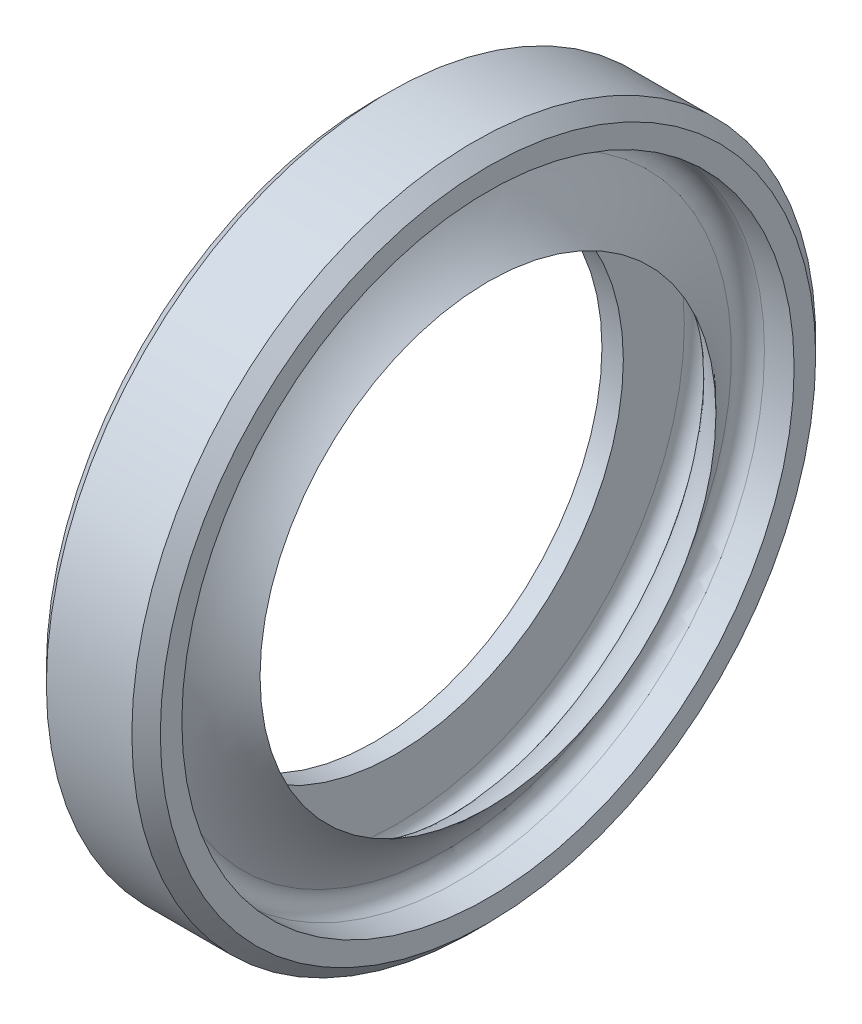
ISO-10303-21;
HEADER;
FILE_DESCRIPTION(('STEP AP214'),'2;1');
FILE_NAME('part.step','',(''),(''),'','','');
FILE_SCHEMA(('AUTOMOTIVE_DESIGN { 1 0 10303 214 1 1 1 1 }'));
ENDSEC;
DATA;
#1=APPLICATION_CONTEXT('core data for automotive mechanical design processes');
#2=APPLICATION_PROTOCOL_DEFINITION('international standard','automotive_design',2000,#1);
#3=PRODUCT_CONTEXT('',#1,'mechanical');
#4=PRODUCT('Part','Part','',(#3));
#5=PRODUCT_RELATED_PRODUCT_CATEGORY('part','',(#4));
#6=PRODUCT_DEFINITION_FORMATION('','',#4);
#7=PRODUCT_DEFINITION_CONTEXT('part definition',#1,'design');
#8=PRODUCT_DEFINITION('design','',#6,#7);
#9=PRODUCT_DEFINITION_SHAPE('','',#8);
#10=(LENGTH_UNIT() NAMED_UNIT(*) SI_UNIT(.MILLI.,.METRE.));
#11=(NAMED_UNIT(*) PLANE_ANGLE_UNIT() SI_UNIT($,.RADIAN.));
#12=(NAMED_UNIT(*) SI_UNIT($,.STERADIAN.) SOLID_ANGLE_UNIT());
#13=UNCERTAINTY_MEASURE_WITH_UNIT(LENGTH_MEASURE(1.E-05),#10,'distance_accuracy_value','');
#14=(GEOMETRIC_REPRESENTATION_CONTEXT(3) GLOBAL_UNCERTAINTY_ASSIGNED_CONTEXT((#13)) GLOBAL_UNIT_ASSIGNED_CONTEXT((#10,
#11,#12)) REPRESENTATION_CONTEXT('',''));
#15=CARTESIAN_POINT('',(0.,0.,0.));
#16=DIRECTION('',(0.,0.,1.));
#17=DIRECTION('',(1.,0.,0.));
#18=AXIS2_PLACEMENT_3D('',#15,#16,#17);
#19=CARTESIAN_POINT('',(-28.1734055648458,0.,0.));
#20=DIRECTION('',(-1.,0.,0.));
#21=DIRECTION('',(0.,0.,1.));
#22=AXIS2_PLACEMENT_3D('',#19,#20,#21);
#23=CYLINDRICAL_SURFACE('',#22,21.4899747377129);
#24=CARTESIAN_POINT('',(2.88061686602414,0.,0.));
#25=DIRECTION('',(-1.,0.,0.));
#26=DIRECTION('',(0.,0.,1.));
#27=AXIS2_PLACEMENT_3D('',#24,#25,#26);
#28=CIRCLE('',#27,21.4899747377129);
#29=CARTESIAN_POINT('',(2.88061686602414,0.,21.4899747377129));
#30=VERTEX_POINT('',#29);
#31=EDGE_CURVE('E10',#30,#30,#28,.T.);
#32=ORIENTED_EDGE('',*,*,#31,.F.);
#33=EDGE_LOOP('',(#32));
#34=FACE_BOUND('',#33,.T.);
#35=CARTESIAN_POINT('',(0.796577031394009,0.,0.));
#36=DIRECTION('',(-1.,0.,0.));
#37=DIRECTION('',(0.,0.,1.));
#38=AXIS2_PLACEMENT_3D('',#35,#36,#37);
#39=CIRCLE('',#38,21.4899747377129);
#40=CARTESIAN_POINT('',(0.796577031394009,0.,21.4899747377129));
#41=VERTEX_POINT('',#40);
#42=EDGE_CURVE('E69',#41,#41,#39,.T.);
#43=ORIENTED_EDGE('',*,*,#42,.T.);
#44=EDGE_LOOP('',(#43));
#45=FACE_BOUND('',#44,.T.);
#46=ADVANCED_FACE('F29',(#34,#45),#23,.F.);
#47=CARTESIAN_POINT('',(2.88061686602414,23.,0.));
#48=DIRECTION('',(-1.,0.,0.));
#49=DIRECTION('',(0.,0.,1.));
#50=AXIS2_PLACEMENT_3D('',#47,#48,#49);
#51=PLANE('',#50);
#52=CARTESIAN_POINT('',(2.88061686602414,0.,0.));
#53=DIRECTION('',(-1.,0.,0.));
#54=DIRECTION('',(0.,0.,1.));
#55=AXIS2_PLACEMENT_3D('',#52,#53,#54);
#56=CIRCLE('',#55,23.);
#57=CARTESIAN_POINT('',(2.88061686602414,0.,23.));
#58=VERTEX_POINT('',#57);
#59=EDGE_CURVE('E35',#58,#58,#56,.T.);
#60=ORIENTED_EDGE('',*,*,#59,.F.);
#61=EDGE_LOOP('',(#60));
#62=FACE_BOUND('',#61,.T.);
#63=ORIENTED_EDGE('',*,*,#31,.T.);
#64=EDGE_LOOP('',(#63));
#65=FACE_BOUND('',#64,.T.);
#66=ADVANCED_FACE('F130',(#62,#65),#51,.F.);
#67=CARTESIAN_POINT('',(2.88061686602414,0.,0.));
#68=DIRECTION('',(-1.,0.,0.));
#69=DIRECTION('',(0.,0.,1.));
#70=AXIS2_PLACEMENT_3D('',#67,#68,#69);
#71=CONICAL_SURFACE('',#70,23.,0.785398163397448);
#72=CARTESIAN_POINT('',(1.88061686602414,0.,0.));
#73=DIRECTION('',(-1.,0.,0.));
#74=DIRECTION('',(0.,0.,1.));
#75=AXIS2_PLACEMENT_3D('',#72,#73,#74);
#76=CIRCLE('',#75,24.);
#77=CARTESIAN_POINT('',(1.88061686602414,0.,24.));
#78=VERTEX_POINT('',#77);
#79=EDGE_CURVE('E39',#78,#78,#76,.T.);
#80=ORIENTED_EDGE('',*,*,#79,.F.);
#81=EDGE_LOOP('',(#80));
#82=FACE_BOUND('',#81,.T.);
#83=ORIENTED_EDGE('',*,*,#59,.T.);
#84=EDGE_LOOP('',(#83));
#85=FACE_BOUND('',#84,.T.);
#86=ADVANCED_FACE('F125',(#82,#85),#71,.T.);
#87=CARTESIAN_POINT('',(-28.1734055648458,0.,0.));
#88=DIRECTION('',(-1.,0.,0.));
#89=DIRECTION('',(0.,0.,1.));
#90=AXIS2_PLACEMENT_3D('',#87,#88,#89);
#91=CYLINDRICAL_SURFACE('',#90,24.);
#92=CARTESIAN_POINT('',(-4.11938313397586,0.,0.));
#93=DIRECTION('',(-1.,0.,0.));
#94=DIRECTION('',(0.,0.,1.));
#95=AXIS2_PLACEMENT_3D('',#92,#93,#94);
#96=CIRCLE('',#95,24.);
#97=CARTESIAN_POINT('',(-4.11938313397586,0.,24.));
#98=VERTEX_POINT('',#97);
#99=EDGE_CURVE('E43',#98,#98,#96,.T.);
#100=ORIENTED_EDGE('',*,*,#99,.F.);
#101=EDGE_LOOP('',(#100));
#102=FACE_BOUND('',#101,.T.);
#103=ORIENTED_EDGE('',*,*,#79,.T.);
#104=EDGE_LOOP('',(#103));
#105=FACE_BOUND('',#104,.T.);
#106=ADVANCED_FACE('F119',(#102,#105),#91,.T.);
#107=CARTESIAN_POINT('',(-4.11938313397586,0.,0.));
#108=DIRECTION('',(1.,0.,0.));
#109=DIRECTION('',(0.,0.,-1.));
#110=AXIS2_PLACEMENT_3D('',#107,#108,#109);
#111=CONICAL_SURFACE('',#110,24.,0.785398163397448);
#112=CARTESIAN_POINT('',(-5.11938313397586,0.,0.));
#113=DIRECTION('',(-1.,0.,0.));
#114=DIRECTION('',(0.,0.,1.));
#115=AXIS2_PLACEMENT_3D('',#112,#113,#114);
#116=CIRCLE('',#115,23.);
#117=CARTESIAN_POINT('',(-5.11938313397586,0.,23.));
#118=VERTEX_POINT('',#117);
#119=EDGE_CURVE('E48',#118,#118,#116,.T.);
#120=ORIENTED_EDGE('',*,*,#119,.F.);
#121=EDGE_LOOP('',(#120));
#122=FACE_BOUND('',#121,.T.);
#123=ORIENTED_EDGE('',*,*,#99,.T.);
#124=EDGE_LOOP('',(#123));
#125=FACE_BOUND('',#124,.T.);
#126=ADVANCED_FACE('F113',(#122,#125),#111,.T.);
#127=CARTESIAN_POINT('',(-5.11938313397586,16.,0.));
#128=DIRECTION('',(1.,0.,0.));
#129=DIRECTION('',(0.,0.,-1.));
#130=AXIS2_PLACEMENT_3D('',#127,#128,#129);
#131=PLANE('',#130);
#132=CARTESIAN_POINT('',(-5.11938313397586,0.,0.));
#133=DIRECTION('',(-1.,0.,0.));
#134=DIRECTION('',(0.,0.,1.));
#135=AXIS2_PLACEMENT_3D('',#132,#133,#134);
#136=CIRCLE('',#135,16.);
#137=CARTESIAN_POINT('',(-5.11938313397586,0.,16.));
#138=VERTEX_POINT('',#137);
#139=EDGE_CURVE('E51',#138,#138,#136,.T.);
#140=ORIENTED_EDGE('',*,*,#139,.F.);
#141=EDGE_LOOP('',(#140));
#142=FACE_BOUND('',#141,.T.);
#143=ORIENTED_EDGE('',*,*,#119,.T.);
#144=EDGE_LOOP('',(#143));
#145=FACE_BOUND('',#144,.T.);
#146=ADVANCED_FACE('F107',(#142,#145),#131,.F.);
#147=CARTESIAN_POINT('',(-28.1734055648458,0.,0.));
#148=DIRECTION('',(-1.,0.,0.));
#149=DIRECTION('',(0.,0.,1.));
#150=AXIS2_PLACEMENT_3D('',#147,#148,#149);
#151=CYLINDRICAL_SURFACE('',#150,16.);
#152=CARTESIAN_POINT('',(-3.61938313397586,0.,0.));
#153=DIRECTION('',(-1.,0.,0.));
#154=DIRECTION('',(0.,0.,1.));
#155=AXIS2_PLACEMENT_3D('',#152,#153,#154);
#156=CIRCLE('',#155,16.);
#157=CARTESIAN_POINT('',(-3.61938313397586,0.,16.));
#158=VERTEX_POINT('',#157);
#159=EDGE_CURVE('E54',#158,#158,#156,.T.);
#160=ORIENTED_EDGE('',*,*,#159,.F.);
#161=EDGE_LOOP('',(#160));
#162=FACE_BOUND('',#161,.T.);
#163=ORIENTED_EDGE('',*,*,#139,.T.);
#164=EDGE_LOOP('',(#163));
#165=FACE_BOUND('',#164,.T.);
#166=ADVANCED_FACE('F101',(#162,#165),#151,.F.);
#167=CARTESIAN_POINT('',(-3.61938313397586,20.2798516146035,0.));
#168=DIRECTION('',(-1.,0.,0.));
#169=DIRECTION('',(0.,0.,1.));
#170=AXIS2_PLACEMENT_3D('',#167,#168,#169);
#171=PLANE('',#170);
#172=CARTESIAN_POINT('',(-3.61938313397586,0.,0.));
#173=DIRECTION('',(-1.,0.,0.));
#174=DIRECTION('',(0.,0.,1.));
#175=AXIS2_PLACEMENT_3D('',#172,#173,#174);
#176=CIRCLE('',#175,20.2798516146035);
#177=CARTESIAN_POINT('',(-3.61938313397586,0.,20.2798516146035));
#178=VERTEX_POINT('',#177);
#179=EDGE_CURVE('E57',#178,#178,#176,.T.);
#180=ORIENTED_EDGE('',*,*,#179,.F.);
#181=EDGE_LOOP('',(#180));
#182=FACE_BOUND('',#181,.T.);
#183=ORIENTED_EDGE('',*,*,#159,.T.);
#184=EDGE_LOOP('',(#183));
#185=FACE_BOUND('',#184,.T.);
#186=ADVANCED_FACE('F95',(#182,#185),#171,.F.);
#187=CARTESIAN_POINT('',(-2.61076173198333,0.,0.));
#188=DIRECTION('',(-1.,0.,0.));
#189=DIRECTION('',(0.,0.,1.));
#190=AXIS2_PLACEMENT_3D('',#187,#188,#189);
#191=TOROIDAL_SURFACE('',#190,20.2755566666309,1.00863054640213);
#192=CARTESIAN_POINT('',(-1.76349805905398,0.,0.));
#193=DIRECTION('',(-1.,0.,0.));
#194=DIRECTION('',(0.,0.,1.));
#195=AXIS2_PLACEMENT_3D('',#192,#193,#194);
#196=CIRCLE('',#195,20.8228041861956);
#197=CARTESIAN_POINT('',(-1.76349805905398,0.,20.8228041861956));
#198=VERTEX_POINT('',#197);
#199=EDGE_CURVE('E60',#198,#198,#196,.T.);
#200=ORIENTED_EDGE('',*,*,#199,.F.);
#201=EDGE_LOOP('',(#200));
#202=FACE_BOUND('',#201,.T.);
#203=ORIENTED_EDGE('',*,*,#179,.T.);
#204=EDGE_LOOP('',(#203));
#205=FACE_BOUND('',#204,.T.);
#206=ADVANCED_FACE('F89',(#202,#205),#191,.F.);
#207=CARTESIAN_POINT('',(6.34133373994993,0.,0.));
#208=DIRECTION('',(-1.,0.,0.));
#209=DIRECTION('',(0.,0.,1.));
#210=AXIS2_PLACEMENT_3D('',#207,#208,#209);
#211=TOROIDAL_SURFACE('',#210,23.9799194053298,8.69802707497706);
#212=CARTESIAN_POINT('',(2.88061686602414,0.,0.));
#213=DIRECTION('',(-1.,0.,0.));
#214=DIRECTION('',(0.,0.,1.));
#215=AXIS2_PLACEMENT_3D('',#212,#213,#214);
#216=CIRCLE('',#215,16.);
#217=CARTESIAN_POINT('',(2.88061686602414,0.,16.));
#218=VERTEX_POINT('',#217);
#219=EDGE_CURVE('E63',#218,#218,#216,.T.);
#220=ORIENTED_EDGE('',*,*,#219,.F.);
#221=EDGE_LOOP('',(#220));
#222=FACE_BOUND('',#221,.T.);
#223=ORIENTED_EDGE('',*,*,#199,.T.);
#224=EDGE_LOOP('',(#223));
#225=FACE_BOUND('',#224,.T.);
#226=ADVANCED_FACE('F83',(#222,#225),#211,.T.);
#227=CARTESIAN_POINT('',(10.3198740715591,0.,0.));
#228=DIRECTION('',(-1.,0.,0.));
#229=DIRECTION('',(0.,0.,1.));
#230=AXIS2_PLACEMENT_3D('',#227,#228,#229);
#231=TOROIDAL_SURFACE('',#230,24.6033750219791,11.3736805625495);
#232=CARTESIAN_POINT('',(-0.121447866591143,0.,0.));
#233=DIRECTION('',(-1.,0.,0.));
#234=DIRECTION('',(0.,0.,1.));
#235=AXIS2_PLACEMENT_3D('',#232,#233,#234);
#236=CIRCLE('',#235,20.0934519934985);
#237=CARTESIAN_POINT('',(-0.121447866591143,0.,20.0934519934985));
#238=VERTEX_POINT('',#237);
#239=EDGE_CURVE('E66',#238,#238,#236,.T.);
#240=ORIENTED_EDGE('',*,*,#239,.F.);
#241=EDGE_LOOP('',(#240));
#242=FACE_BOUND('',#241,.T.);
#243=ORIENTED_EDGE('',*,*,#219,.T.);
#244=EDGE_LOOP('',(#243));
#245=FACE_BOUND('',#244,.T.);
#246=ADVANCED_FACE('F77',(#242,#245),#231,.F.);
#247=CARTESIAN_POINT('',(0.796577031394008,0.,0.));
#248=DIRECTION('',(-1.,0.,0.));
#249=DIRECTION('',(0.,0.,1.));
#250=AXIS2_PLACEMENT_3D('',#247,#248,#249);
#251=TOROIDAL_SURFACE('',#250,20.4899747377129,0.999999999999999);
#252=ORIENTED_EDGE('',*,*,#42,.F.);
#253=EDGE_LOOP('',(#252));
#254=FACE_BOUND('',#253,.T.);
#255=ORIENTED_EDGE('',*,*,#239,.T.);
#256=EDGE_LOOP('',(#255));
#257=FACE_BOUND('',#256,.T.);
#258=ADVANCED_FACE('F74',(#254,#257),#251,.F.);
#259=CLOSED_SHELL('',(#46,#66,#86,#106,#126,#146,#166,#186,#206,#226,#246,#258));
#260=MANIFOLD_SOLID_BREP('B2',#259);
#261=ADVANCED_BREP_SHAPE_REPRESENTATION('',(#18,#260),#14);
#262=SHAPE_DEFINITION_REPRESENTATION(#9,#261);
ENDSEC;
END-ISO-10303-21;
